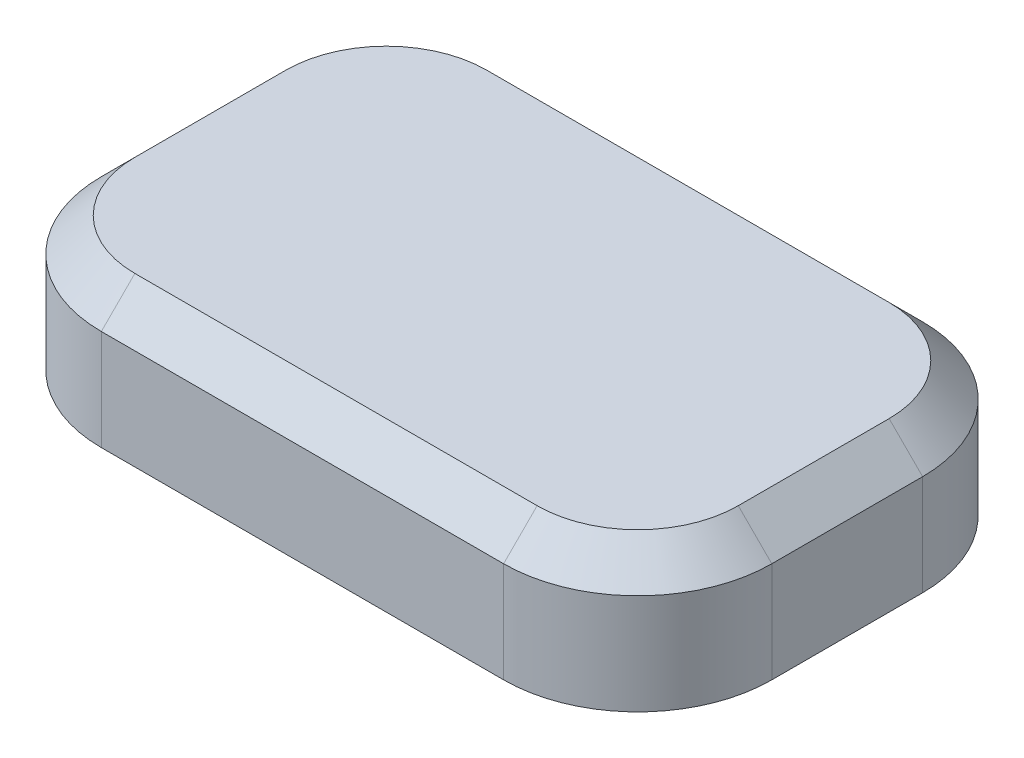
from build123d import *

# Parameters (mm, degrees)
SKETCH1_W      = 200
SKETCH1_H      = 125
EXTRUDE1_DEPTH = 40
FILLET1_R      = 40
CHAMFER3_SIZE  = 10


with BuildPart() as part:
    # Sketch1 → Extrude1 (new body)
    with BuildSketch(Plane(origin=(0, 0, 0), x_dir=(1, 0, 0), z_dir=(0, 1, 0))):
        Rectangle(SKETCH1_W, SKETCH1_H)
    extrude(amount=EXTRUDE1_DEPTH)

    # Fillet1
    fillet1_edges = [part.edges().sort_by_distance(p)[0] for p in [
        (-100, 20, -62.5),
        (100, 20, -62.5),
        (100, 20, 62.5),
        (-100, 20, 62.5),
    ]]
    fillet(fillet1_edges, radius=FILLET1_R)

    # Chamfer3
    chamfer3_edges = [part.edges().sort_by_distance(p)[0] for p in [
        (-100, 40, 0),
        (0, 40, -62.5),
        (0, 40, 62.5),
        (100, 40, 0),
        (88.284271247, 40, 50.784271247),
        (88.284271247, 40, -50.784271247),
        (-88.284271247, 40, 50.784271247),
        (-88.284271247, 40, -50.784271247),
    ]]
    chamfer(chamfer3_edges, length=CHAMFER3_SIZE)


solid = part.part
